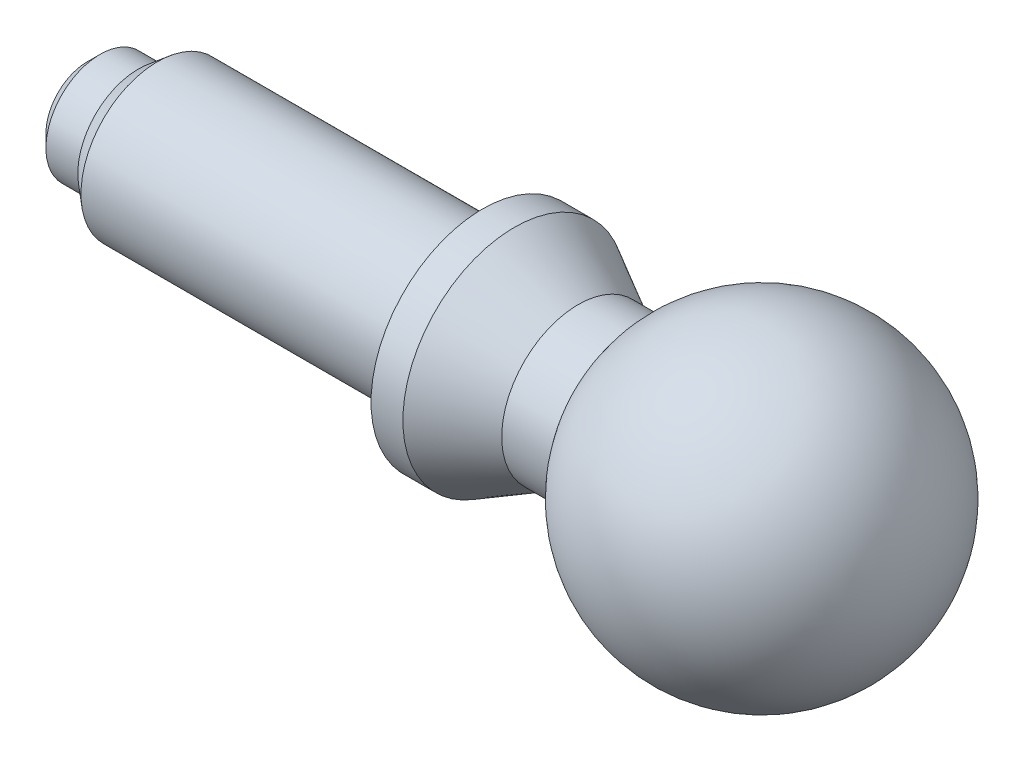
ISO-10303-21;
HEADER;
FILE_DESCRIPTION(('STEP AP214'),'2;1');
FILE_NAME('part.step','',(''),(''),'','','');
FILE_SCHEMA(('AUTOMOTIVE_DESIGN { 1 0 10303 214 1 1 1 1 }'));
ENDSEC;
DATA;
#1=APPLICATION_CONTEXT('core data for automotive mechanical design processes');
#2=APPLICATION_PROTOCOL_DEFINITION('international standard','automotive_design',2000,#1);
#3=PRODUCT_CONTEXT('',#1,'mechanical');
#4=PRODUCT('Part','Part','',(#3));
#5=PRODUCT_RELATED_PRODUCT_CATEGORY('part','',(#4));
#6=PRODUCT_DEFINITION_FORMATION('','',#4);
#7=PRODUCT_DEFINITION_CONTEXT('part definition',#1,'design');
#8=PRODUCT_DEFINITION('design','',#6,#7);
#9=PRODUCT_DEFINITION_SHAPE('','',#8);
#10=(LENGTH_UNIT() NAMED_UNIT(*) SI_UNIT(.MILLI.,.METRE.));
#11=(NAMED_UNIT(*) PLANE_ANGLE_UNIT() SI_UNIT($,.RADIAN.));
#12=(NAMED_UNIT(*) SI_UNIT($,.STERADIAN.) SOLID_ANGLE_UNIT());
#13=UNCERTAINTY_MEASURE_WITH_UNIT(LENGTH_MEASURE(1.E-05),#10,'distance_accuracy_value','');
#14=(GEOMETRIC_REPRESENTATION_CONTEXT(3) GLOBAL_UNCERTAINTY_ASSIGNED_CONTEXT((#13)) GLOBAL_UNIT_ASSIGNED_CONTEXT((#10,
#11,#12)) REPRESENTATION_CONTEXT('',''));
#15=CARTESIAN_POINT('',(0.,0.,0.));
#16=DIRECTION('',(0.,0.,1.));
#17=DIRECTION('',(1.,0.,0.));
#18=AXIS2_PLACEMENT_3D('',#15,#16,#17);
#19=CARTESIAN_POINT('',(105.784609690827,0.,0.));
#20=DIRECTION('',(1.,0.,0.));
#21=DIRECTION('',(0.,1.,0.));
#22=AXIS2_PLACEMENT_3D('',#19,#20,#21);
#23=SPHERICAL_SURFACE('',#22,24.);
#24=CARTESIAN_POINT('',(85.,0.,0.));
#25=DIRECTION('',(1.,0.,0.));
#26=DIRECTION('',(0.,0.,-1.));
#27=AXIS2_PLACEMENT_3D('',#24,#25,#26);
#28=CIRCLE('',#27,12.);
#29=CARTESIAN_POINT('',(85.,0.,-12.));
#30=VERTEX_POINT('',#29);
#31=EDGE_CURVE('E12',#30,#30,#28,.T.);
#32=ORIENTED_EDGE('',*,*,#31,.T.);
#33=EDGE_LOOP('',(#32));
#34=FACE_BOUND('',#33,.T.);
#35=ADVANCED_FACE('F36',(#34),#23,.T.);
#36=CARTESIAN_POINT('',(134.439404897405,0.,0.));
#37=DIRECTION('',(1.,0.,0.));
#38=DIRECTION('',(0.,0.,-1.));
#39=AXIS2_PLACEMENT_3D('',#36,#37,#38);
#40=CYLINDRICAL_SURFACE('',#39,12.);
#41=CARTESIAN_POINT('',(77.,0.,0.));
#42=DIRECTION('',(1.,0.,0.));
#43=DIRECTION('',(0.,0.,-1.));
#44=AXIS2_PLACEMENT_3D('',#41,#42,#43);
#45=CIRCLE('',#44,12.);
#46=CARTESIAN_POINT('',(77.,0.,-12.));
#47=VERTEX_POINT('',#46);
#48=EDGE_CURVE('E42',#47,#47,#45,.T.);
#49=ORIENTED_EDGE('',*,*,#48,.T.);
#50=EDGE_LOOP('',(#49));
#51=FACE_BOUND('',#50,.T.);
#52=ORIENTED_EDGE('',*,*,#31,.F.);
#53=EDGE_LOOP('',(#52));
#54=FACE_BOUND('',#53,.T.);
#55=ADVANCED_FACE('F86',(#51,#54),#40,.T.);
#56=CARTESIAN_POINT('',(77.,0.,0.));
#57=DIRECTION('',(-1.,0.,0.));
#58=DIRECTION('',(0.,0.,1.));
#59=AXIS2_PLACEMENT_3D('',#56,#57,#58);
#60=CONICAL_SURFACE('',#59,12.,0.502843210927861);
#61=CARTESIAN_POINT('',(67.,0.,0.));
#62=DIRECTION('',(1.,0.,0.));
#63=DIRECTION('',(0.,0.,-1.));
#64=AXIS2_PLACEMENT_3D('',#61,#62,#63);
#65=CIRCLE('',#64,17.5);
#66=CARTESIAN_POINT('',(67.,0.,-17.5));
#67=VERTEX_POINT('',#66);
#68=EDGE_CURVE('E46',#67,#67,#65,.T.);
#69=ORIENTED_EDGE('',*,*,#68,.T.);
#70=EDGE_LOOP('',(#69));
#71=FACE_BOUND('',#70,.T.);
#72=ORIENTED_EDGE('',*,*,#48,.F.);
#73=EDGE_LOOP('',(#72));
#74=FACE_BOUND('',#73,.T.);
#75=ADVANCED_FACE('F90',(#71,#74),#60,.T.);
#76=CARTESIAN_POINT('',(134.439404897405,0.,0.));
#77=DIRECTION('',(1.,0.,0.));
#78=DIRECTION('',(0.,0.,-1.));
#79=AXIS2_PLACEMENT_3D('',#76,#77,#78);
#80=CYLINDRICAL_SURFACE('',#79,17.5);
#81=CARTESIAN_POINT('',(62.,0.,0.));
#82=DIRECTION('',(1.,0.,0.));
#83=DIRECTION('',(0.,0.,-1.));
#84=AXIS2_PLACEMENT_3D('',#81,#82,#83);
#85=CIRCLE('',#84,17.5);
#86=CARTESIAN_POINT('',(62.,0.,-17.5));
#87=VERTEX_POINT('',#86);
#88=EDGE_CURVE('E50',#87,#87,#85,.T.);
#89=ORIENTED_EDGE('',*,*,#88,.T.);
#90=EDGE_LOOP('',(#89));
#91=FACE_BOUND('',#90,.T.);
#92=ORIENTED_EDGE('',*,*,#68,.F.);
#93=EDGE_LOOP('',(#92));
#94=FACE_BOUND('',#93,.T.);
#95=ADVANCED_FACE('F94',(#91,#94),#80,.T.);
#96=CARTESIAN_POINT('',(62.,12.,0.));
#97=DIRECTION('',(-1.,0.,0.));
#98=DIRECTION('',(0.,0.,1.));
#99=AXIS2_PLACEMENT_3D('',#96,#97,#98);
#100=PLANE('',#99);
#101=CARTESIAN_POINT('',(62.,0.,0.));
#102=DIRECTION('',(1.,0.,0.));
#103=DIRECTION('',(0.,0.,-1.));
#104=AXIS2_PLACEMENT_3D('',#101,#102,#103);
#105=CIRCLE('',#104,12.);
#106=CARTESIAN_POINT('',(62.,0.,-12.));
#107=VERTEX_POINT('',#106);
#108=EDGE_CURVE('E55',#107,#107,#105,.T.);
#109=ORIENTED_EDGE('',*,*,#108,.T.);
#110=EDGE_LOOP('',(#109));
#111=FACE_BOUND('',#110,.T.);
#112=ORIENTED_EDGE('',*,*,#88,.F.);
#113=EDGE_LOOP('',(#112));
#114=FACE_BOUND('',#113,.T.);
#115=ADVANCED_FACE('F101',(#111,#114),#100,.T.);
#116=CARTESIAN_POINT('',(134.439404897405,0.,0.));
#117=DIRECTION('',(1.,0.,0.));
#118=DIRECTION('',(0.,0.,-1.));
#119=AXIS2_PLACEMENT_3D('',#116,#117,#118);
#120=CYLINDRICAL_SURFACE('',#119,12.);
#121=CARTESIAN_POINT('',(11.,0.,0.));
#122=DIRECTION('',(1.,0.,0.));
#123=DIRECTION('',(0.,0.,-1.));
#124=AXIS2_PLACEMENT_3D('',#121,#122,#123);
#125=CIRCLE('',#124,12.);
#126=CARTESIAN_POINT('',(11.,0.,-12.));
#127=VERTEX_POINT('',#126);
#128=EDGE_CURVE('E58',#127,#127,#125,.T.);
#129=ORIENTED_EDGE('',*,*,#128,.T.);
#130=EDGE_LOOP('',(#129));
#131=FACE_BOUND('',#130,.T.);
#132=ORIENTED_EDGE('',*,*,#108,.F.);
#133=EDGE_LOOP('',(#132));
#134=FACE_BOUND('',#133,.T.);
#135=ADVANCED_FACE('F105',(#131,#134),#120,.T.);
#136=CARTESIAN_POINT('',(11.,0.,0.));
#137=DIRECTION('',(1.,0.,0.));
#138=DIRECTION('',(0.,0.,-1.));
#139=AXIS2_PLACEMENT_3D('',#136,#137,#138);
#140=CONICAL_SURFACE('',#139,12.,0.694738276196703);
#141=CARTESIAN_POINT('',(8.,0.,0.));
#142=DIRECTION('',(1.,0.,0.));
#143=DIRECTION('',(0.,0.,-1.));
#144=AXIS2_PLACEMENT_3D('',#141,#142,#143);
#145=CIRCLE('',#144,9.5);
#146=CARTESIAN_POINT('',(8.,0.,-9.5));
#147=VERTEX_POINT('',#146);
#148=EDGE_CURVE('E61',#147,#147,#145,.T.);
#149=ORIENTED_EDGE('',*,*,#148,.T.);
#150=EDGE_LOOP('',(#149));
#151=FACE_BOUND('',#150,.T.);
#152=ORIENTED_EDGE('',*,*,#128,.F.);
#153=EDGE_LOOP('',(#152));
#154=FACE_BOUND('',#153,.T.);
#155=ADVANCED_FACE('F109',(#151,#154),#140,.T.);
#156=CARTESIAN_POINT('',(8.,8.49999999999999,0.));
#157=DIRECTION('',(-1.,0.,0.));
#158=DIRECTION('',(0.,0.,1.));
#159=AXIS2_PLACEMENT_3D('',#156,#157,#158);
#160=PLANE('',#159);
#161=CARTESIAN_POINT('',(8.,0.,0.));
#162=DIRECTION('',(1.,0.,0.));
#163=DIRECTION('',(0.,0.,-1.));
#164=AXIS2_PLACEMENT_3D('',#161,#162,#163);
#165=CIRCLE('',#164,8.5);
#166=CARTESIAN_POINT('',(8.,0.,-8.5));
#167=VERTEX_POINT('',#166);
#168=EDGE_CURVE('E64',#167,#167,#165,.T.);
#169=ORIENTED_EDGE('',*,*,#168,.T.);
#170=EDGE_LOOP('',(#169));
#171=FACE_BOUND('',#170,.T.);
#172=ORIENTED_EDGE('',*,*,#148,.F.);
#173=EDGE_LOOP('',(#172));
#174=FACE_BOUND('',#173,.T.);
#175=ADVANCED_FACE('F113',(#171,#174),#160,.T.);
#176=CARTESIAN_POINT('',(134.439404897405,0.,0.));
#177=DIRECTION('',(1.,0.,0.));
#178=DIRECTION('',(0.,0.,-1.));
#179=AXIS2_PLACEMENT_3D('',#176,#177,#178);
#180=CYLINDRICAL_SURFACE('',#179,8.5);
#181=CARTESIAN_POINT('',(2.,0.,0.));
#182=DIRECTION('',(1.,0.,0.));
#183=DIRECTION('',(0.,0.,-1.));
#184=AXIS2_PLACEMENT_3D('',#181,#182,#183);
#185=CIRCLE('',#184,8.5);
#186=CARTESIAN_POINT('',(2.,0.,-8.5));
#187=VERTEX_POINT('',#186);
#188=EDGE_CURVE('E67',#187,#187,#185,.T.);
#189=ORIENTED_EDGE('',*,*,#188,.T.);
#190=EDGE_LOOP('',(#189));
#191=FACE_BOUND('',#190,.T.);
#192=ORIENTED_EDGE('',*,*,#168,.F.);
#193=EDGE_LOOP('',(#192));
#194=FACE_BOUND('',#193,.T.);
#195=ADVANCED_FACE('F83',(#191,#194),#180,.T.);
#196=CARTESIAN_POINT('',(2.,0.,0.));
#197=DIRECTION('',(1.,0.,0.));
#198=DIRECTION('',(0.,0.,-1.));
#199=AXIS2_PLACEMENT_3D('',#196,#197,#198);
#200=CONICAL_SURFACE('',#199,8.5,0.785398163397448);
#201=CARTESIAN_POINT('',(0.,0.,0.));
#202=DIRECTION('',(1.,0.,0.));
#203=DIRECTION('',(0.,0.,-1.));
#204=AXIS2_PLACEMENT_3D('',#201,#202,#203);
#205=CIRCLE('',#204,6.5);
#206=CARTESIAN_POINT('',(0.,0.,-6.5));
#207=VERTEX_POINT('',#206);
#208=EDGE_CURVE('E70',#207,#207,#205,.T.);
#209=ORIENTED_EDGE('',*,*,#208,.T.);
#210=EDGE_LOOP('',(#209));
#211=FACE_BOUND('',#210,.T.);
#212=ORIENTED_EDGE('',*,*,#188,.F.);
#213=EDGE_LOOP('',(#212));
#214=FACE_BOUND('',#213,.T.);
#215=ADVANCED_FACE('F74',(#211,#214),#200,.T.);
#216=CARTESIAN_POINT('',(0.,0.,0.));
#217=DIRECTION('',(-1.,0.,0.));
#218=DIRECTION('',(0.,0.,1.));
#219=AXIS2_PLACEMENT_3D('',#216,#217,#218);
#220=PLANE('',#219);
#221=ORIENTED_EDGE('',*,*,#208,.F.);
#222=EDGE_LOOP('',(#221));
#223=FACE_BOUND('',#222,.T.);
#224=ADVANCED_FACE('F77',(#223),#220,.T.);
#225=CLOSED_SHELL('',(#35,#55,#75,#95,#115,#135,#155,#175,#195,#215,#224));
#226=MANIFOLD_SOLID_BREP('B2',#225);
#227=ADVANCED_BREP_SHAPE_REPRESENTATION('',(#18,#226),#14);
#228=SHAPE_DEFINITION_REPRESENTATION(#9,#227);
ENDSEC;
END-ISO-10303-21;
